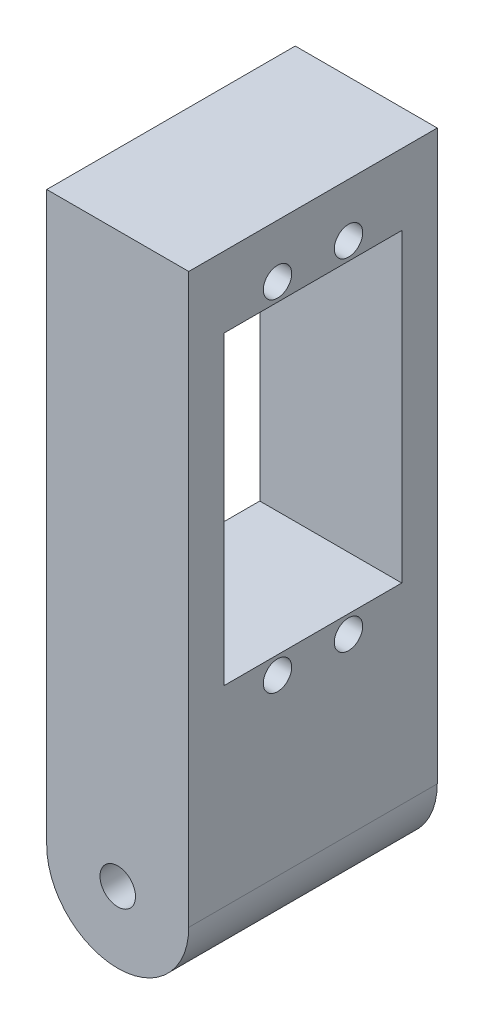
from build123d import *

# Parameters (mm, degrees)
SKETCH2_R           = 2.5
BOSS_EXTRUDE1_DEPTH = 35
SKETCH3_R           = 2
SKETCH3_W           = 25
SKETCH3_H           = 43
CUT_EXTRUDE2_DEPTH  = 35


with BuildPart() as part:
    # Sketch2 → Boss-Extrude1 (new body)
    with BuildSketch(Plane.XY):
        with BuildLine():
            Line((0, 0), (20, 0))
            Line((20, 0), (20, -80))
            ThreePointArc((20, -80), (10, -90), (0, -80))
            Line((0, -80), (0, 0))
        make_face()
        with Locations((10, -80)):
            Circle(SKETCH2_R, mode=Mode.SUBTRACT)
    extrude(amount=BOSS_EXTRUDE1_DEPTH)

    # Sketch3 → Cut-Extrude2 (cut)
    with BuildSketch(Plane.ZY):
        with Locations((12.5, -7.5)):
            Circle(SKETCH3_R)
        with Locations((22.5, -7.5)):
            Circle(SKETCH3_R)
        with Locations((22.5, -55.5)):
            Circle(SKETCH3_R)
        with Locations((12.5, -55.5)):
            Circle(SKETCH3_R)
        with Locations((17.5, -31.5)):
            Rectangle(SKETCH3_W, SKETCH3_H)
    extrude(amount=-CUT_EXTRUDE2_DEPTH, mode=Mode.SUBTRACT)


solid = part.part
